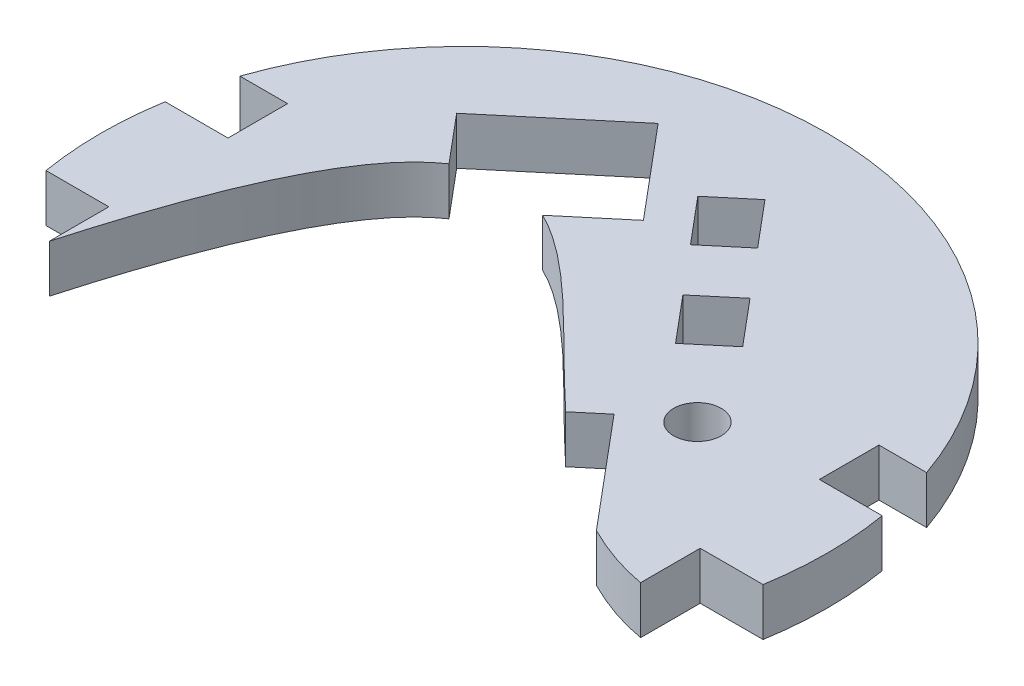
from build123d import *

# Parameters (mm, degrees)
CROQUIS1_R              = 30.5
SALIENTE_EXTRUIR1_DEPTH = 4
CROQUIS2_R              = 2
CORTAR_EXTRUIR1_DEPTH   = 4
CORTAR_EXTRUIR3_START   = -4
CORTAR_EXTRUIR3_DEPTH   = 4
CORTAR_EXTRUIR5_START   = -4
CROQUIS7_R              = 2
CORTAR_EXTRUIR5_DEPTH   = 4
CORTAR_EXTRUIR6_DEPTH   = 10


with BuildPart() as part:
    # Croquis1 → Saliente-Extruir1 (new body)
    with BuildSketch(Plane(origin=(0, 0, 0), x_dir=(1, 0, 0), z_dir=(0, 1, 0))):
        with Locations(Location((0, 0, 0), (0, 0, 270))):
            Circle(CROQUIS1_R)
    extrude(amount=SALIENTE_EXTRUIR1_DEPTH)

    # Croquis2 → Cortar-Extruir1 (cut)
    with BuildSketch(Plane(origin=(0, 4, 0), x_dir=(1, 0, 0), z_dir=(0, 1, 0))):
        with Locations(Location((0, 0, 0), (0, 0, 270))):
            Circle(CROQUIS2_R)
    extrude(amount=-CORTAR_EXTRUIR1_DEPTH, mode=Mode.SUBTRACT)

    # Croquis5 → Cortar-Extruir3 (cut)
    with BuildSketch(Plane(origin=(0, 4, 0), x_dir=(1, 0, 0), z_dir=(0, 1, 0)).offset(CORTAR_EXTRUIR3_START)):
        with BuildLine():
            Line((28.814059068, 5), (30.087372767, 5))
            ThreePointArc((30.087372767, 5), (29.556634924, 7.526973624), (28.814059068, 10))
            Line((28.814059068, 10), (24.814059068, 10))
            Line((24.814059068, 10), (24.814059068, 5))
            Line((24.814059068, 5), (28.814059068, 5))
        make_face()
        with BuildLine():
            Line((30.087372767, -5), (28.814059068, -5))
            Line((28.814059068, -5), (24.814059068, -5))
            Line((24.814059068, -5), (24.814059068, -10))
            Line((24.814059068, -10), (28.814059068, -10))
            ThreePointArc((28.814059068, -10), (29.556634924, -7.526973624), (30.087372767, -5))
        make_face()
        with BuildLine():
            Line((-24.814059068, 5), (-24.814059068, 10))
            Line((-24.814059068, 10), (-28.814059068, 10))
            ThreePointArc((-28.814059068, 10), (-29.556634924, 7.526973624), (-30.087372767, 5))
            Line((-30.087372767, 5), (-28.814059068, 5))
            Line((-28.814059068, 5), (-24.814059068, 5))
        make_face()
        with BuildLine():
            Line((-28.814059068, -10), (-24.814059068, -10))
            Line((-24.814059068, -10), (-24.814059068, -5))
            Line((-24.814059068, -5), (-28.814059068, -5))
            Line((-28.814059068, -5), (-30.087372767, -5))
            ThreePointArc((-30.087372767, -5), (-29.556634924, -7.526973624), (-28.814059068, -10))
        make_face()
    extrude(amount=CORTAR_EXTRUIR3_DEPTH, mode=Mode.SUBTRACT)

    # Croquis7 → Cortar-Extruir5 (cut)
    with BuildSketch(Plane(origin=(0, 4, 0), x_dir=(1, 0, 0), z_dir=(0, 1, 0)).offset(CORTAR_EXTRUIR5_START)):
        with Locations(Location((15.526809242, 4.053864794, 0), (0, 0, 270))):
            Circle(CROQUIS7_R)
        Polygon((2.194434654, 23.054217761), (-0.869743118, 20.483067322), (2.34419493, 16.652845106), (5.408372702, 19.223995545), align=None)
        with BuildLine():
            Line((-24.814059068, -10), (-28.814059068, -10))
            ThreePointArc((-28.814059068, -10), (0, -30.5), (28.814059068, -10))
            Line((28.814059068, -10), (24.814059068, -10))
            add(Edge.make_bspline(
                [(24.814059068, -10), (22.863263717, -9.657344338), (20.984021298, -8.980450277), (19.168992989, -8.065339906)],
                knots=[0, 0, 0, 0, 0.087850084, 0.087850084, 0.087850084, 0.087850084], degree=3))
            Line((19.168992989, -8.065339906), (11.455541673, 1.127193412))
            Line((11.455541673, 1.127193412), (9.248678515, -0.72458465))
            add(Edge.make_bspline(
                [(9.248678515, -0.72458465), (3.657558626, 4.465361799), (-1.318373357, 10.288134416), (-5.99647718, 12.591356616)],
                knots=[0.258799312, 0.258799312, 0.258799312, 0.258799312, 0.567154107, 0.567154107, 0.567154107, 0.567154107], degree=3))
            Line((-5.99647718, 12.591356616), (-1.400210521, 16.448082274))
            Line((-1.400210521, 16.448082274), (-7.828086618, 24.108526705))
            Line((-7.828086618, 24.108526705), (-17.020619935, 16.395075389))
            Line((-17.020619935, 16.395075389), (-13.66601447, 12.397212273))
            add(Edge.make_bspline(
                [(-13.66601447, 12.397212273), (-17.403465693, 9.897923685), (-21.056529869, 3.255841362), (-24.814059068, -10)],
                knots=[0.740637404, 0.740637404, 0.740637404, 0.740637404, 1, 1, 1, 1], degree=3))
        make_face()
    extrude(amount=CORTAR_EXTRUIR5_DEPTH, mode=Mode.SUBTRACT)

    # Croquis9 → Cortar-Extruir6 (cut)
    with BuildSketch(Plane(origin=(0, 4, 0), x_dir=(1, 0, 0), z_dir=(0, 1, 0))):
        Polygon((8.737462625, 15.25654067), (5.673284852, 12.685390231), (8.887222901, 8.855168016), (11.951400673, 11.426318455), align=None)
    extrude(amount=-CORTAR_EXTRUIR6_DEPTH, mode=Mode.SUBTRACT)


solid = part.part
